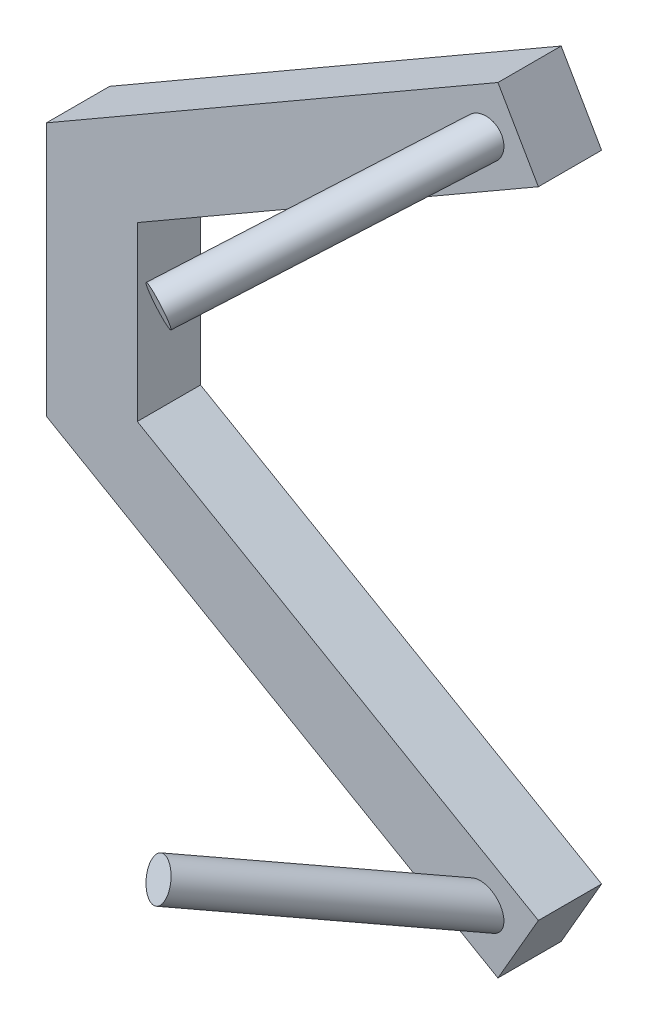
ISO-10303-21;
HEADER;
FILE_DESCRIPTION(('STEP AP214'),'2;1');
FILE_NAME('part.step','',(''),(''),'','','');
FILE_SCHEMA(('AUTOMOTIVE_DESIGN { 1 0 10303 214 1 1 1 1 }'));
ENDSEC;
DATA;
#1=APPLICATION_CONTEXT('core data for automotive mechanical design processes');
#2=APPLICATION_PROTOCOL_DEFINITION('international standard','automotive_design',2000,#1);
#3=PRODUCT_CONTEXT('',#1,'mechanical');
#4=PRODUCT('Part','Part','',(#3));
#5=PRODUCT_RELATED_PRODUCT_CATEGORY('part','',(#4));
#6=PRODUCT_DEFINITION_FORMATION('','',#4);
#7=PRODUCT_DEFINITION_CONTEXT('part definition',#1,'design');
#8=PRODUCT_DEFINITION('design','',#6,#7);
#9=PRODUCT_DEFINITION_SHAPE('','',#8);
#10=(LENGTH_UNIT() NAMED_UNIT(*) SI_UNIT(.MILLI.,.METRE.));
#11=(NAMED_UNIT(*) PLANE_ANGLE_UNIT() SI_UNIT($,.RADIAN.));
#12=(NAMED_UNIT(*) SI_UNIT($,.STERADIAN.) SOLID_ANGLE_UNIT());
#13=UNCERTAINTY_MEASURE_WITH_UNIT(LENGTH_MEASURE(1.E-05),#10,'distance_accuracy_value','');
#14=(GEOMETRIC_REPRESENTATION_CONTEXT(3) GLOBAL_UNCERTAINTY_ASSIGNED_CONTEXT((#13)) GLOBAL_UNIT_ASSIGNED_CONTEXT((#10,
#11,#12)) REPRESENTATION_CONTEXT('',''));
#15=CARTESIAN_POINT('',(0.,0.,0.));
#16=DIRECTION('',(0.,0.,1.));
#17=DIRECTION('',(1.,0.,0.));
#18=AXIS2_PLACEMENT_3D('',#15,#16,#17);
#19=CARTESIAN_POINT('',(0.,-200.960659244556,-100.));
#20=DIRECTION('',(-1.,0.,0.));
#21=DIRECTION('',(0.,-1.,0.));
#22=AXIS2_PLACEMENT_3D('',#19,#20,#21);
#23=PLANE('',#22);
#24=DIRECTION('',(0.,-1.,0.));
#25=VECTOR('',#24,1.);
#26=CARTESIAN_POINT('',(0.,-200.960659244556,0.));
#27=LINE('',#26,#25);
#28=CARTESIAN_POINT('',(0.,200.960659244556,0.));
#29=VERTEX_POINT('',#28);
#30=CARTESIAN_POINT('',(0.,-200.960659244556,0.));
#31=VERTEX_POINT('',#30);
#32=EDGE_CURVE('E125',#29,#31,#27,.T.);
#33=ORIENTED_EDGE('',*,*,#32,.F.);
#34=DIRECTION('',(0.,0.,1.));
#35=VECTOR('',#34,1.);
#36=CARTESIAN_POINT('',(0.,200.960659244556,-100.));
#37=LINE('',#36,#35);
#38=CARTESIAN_POINT('',(0.,200.960659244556,-100.));
#39=VERTEX_POINT('',#38);
#40=EDGE_CURVE('E117',#39,#29,#37,.T.);
#41=ORIENTED_EDGE('',*,*,#40,.F.);
#42=DIRECTION('',(0.,-1.,0.));
#43=VECTOR('',#42,1.);
#44=CARTESIAN_POINT('',(0.,-200.960659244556,-100.));
#45=LINE('',#44,#43);
#46=CARTESIAN_POINT('',(0.,-200.960659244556,-100.));
#47=VERTEX_POINT('',#46);
#48=EDGE_CURVE('E103',#39,#47,#45,.T.);
#49=ORIENTED_EDGE('',*,*,#48,.T.);
#50=DIRECTION('',(0.,0.,1.));
#51=VECTOR('',#50,1.);
#52=CARTESIAN_POINT('',(0.,-200.960659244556,-100.));
#53=LINE('',#52,#51);
#54=EDGE_CURVE('E76',#47,#31,#53,.T.);
#55=ORIENTED_EDGE('',*,*,#54,.T.);
#56=EDGE_LOOP('',(#33,#41,#49,#55));
#57=FACE_BOUND('',#56,.T.);
#58=ADVANCED_FACE('F33',(#57),#23,.T.);
#59=CARTESIAN_POINT('',(143.761573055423,0.,-100.));
#60=DIRECTION('',(1.,0.,0.));
#61=DIRECTION('',(0.,0.,-1.));
#62=AXIS2_PLACEMENT_3D('',#59,#60,#61);
#63=PLANE('',#62);
#64=DIRECTION('',(0.,1.,0.));
#65=VECTOR('',#64,1.);
#66=CARTESIAN_POINT('',(143.761573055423,0.,0.));
#67=LINE('',#66,#65);
#68=CARTESIAN_POINT('',(143.761573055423,-136.228327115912,0.));
#69=VERTEX_POINT('',#68);
#70=CARTESIAN_POINT('',(143.761573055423,136.228327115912,0.));
#71=VERTEX_POINT('',#70);
#72=EDGE_CURVE('E112',#69,#71,#67,.T.);
#73=ORIENTED_EDGE('',*,*,#72,.F.);
#74=DIRECTION('',(0.,0.,1.));
#75=VECTOR('',#74,1.);
#76=CARTESIAN_POINT('',(143.761573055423,-136.228327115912,-100.));
#77=LINE('',#76,#75);
#78=CARTESIAN_POINT('',(143.761573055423,-136.228327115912,-100.));
#79=VERTEX_POINT('',#78);
#80=EDGE_CURVE('E41',#79,#69,#77,.T.);
#81=ORIENTED_EDGE('',*,*,#80,.F.);
#82=DIRECTION('',(0.,1.,0.));
#83=VECTOR('',#82,1.);
#84=CARTESIAN_POINT('',(143.761573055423,0.,-100.));
#85=LINE('',#84,#83);
#86=CARTESIAN_POINT('',(143.761573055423,136.228327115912,-100.));
#87=VERTEX_POINT('',#86);
#88=EDGE_CURVE('E147',#79,#87,#85,.T.);
#89=ORIENTED_EDGE('',*,*,#88,.T.);
#90=DIRECTION('',(0.,0.,1.));
#91=VECTOR('',#90,1.);
#92=CARTESIAN_POINT('',(143.761573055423,136.228327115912,-100.));
#93=LINE('',#92,#91);
#94=EDGE_CURVE('E139',#87,#71,#93,.T.);
#95=ORIENTED_EDGE('',*,*,#94,.T.);
#96=EDGE_LOOP('',(#73,#81,#89,#95));
#97=FACE_BOUND('',#96,.T.);
#98=ADVANCED_FACE('F188',(#97),#63,.T.);
#99=CARTESIAN_POINT('',(143.761573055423,-136.228327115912,-100.));
#100=DIRECTION('',(0.500000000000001,0.866025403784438,0.));
#101=DIRECTION('',(-0.866025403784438,0.500000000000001,0.));
#102=AXIS2_PLACEMENT_3D('',#99,#100,#101);
#103=PLANE('',#102);
#104=DIRECTION('',(-0.866025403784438,0.500000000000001,0.));
#105=VECTOR('',#104,1.);
#106=CARTESIAN_POINT('',(143.761573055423,-136.228327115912,0.));
#107=LINE('',#106,#105);
#108=CARTESIAN_POINT('',(778.0726446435,-502.44799504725,0.));
#109=VERTEX_POINT('',#108);
#110=EDGE_CURVE('E156',#109,#69,#107,.T.);
#111=ORIENTED_EDGE('',*,*,#110,.F.);
#112=DIRECTION('',(0.,0.,1.));
#113=VECTOR('',#112,1.);
#114=CARTESIAN_POINT('',(778.0726446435,-502.44799504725,-100.));
#115=LINE('',#114,#113);
#116=CARTESIAN_POINT('',(778.0726446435,-502.44799504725,-100.));
#117=VERTEX_POINT('',#116);
#118=EDGE_CURVE('E66',#117,#109,#115,.T.);
#119=ORIENTED_EDGE('',*,*,#118,.F.);
#120=DIRECTION('',(-0.866025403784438,0.500000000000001,0.));
#121=VECTOR('',#120,1.);
#122=CARTESIAN_POINT('',(143.761573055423,-136.228327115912,-100.));
#123=LINE('',#122,#121);
#124=EDGE_CURVE('E145',#117,#79,#123,.T.);
#125=ORIENTED_EDGE('',*,*,#124,.T.);
#126=ORIENTED_EDGE('',*,*,#80,.T.);
#127=EDGE_LOOP('',(#111,#119,#125,#126));
#128=FACE_BOUND('',#127,.T.);
#129=ADVANCED_FACE('F205',(#128),#103,.T.);
#130=CARTESIAN_POINT('',(778.0726446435,-502.44799504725,-100.));
#131=DIRECTION('',(0.866025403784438,-0.500000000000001,0.));
#132=DIRECTION('',(0.500000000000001,0.866025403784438,0.));
#133=AXIS2_PLACEMENT_3D('',#130,#131,#132);
#134=PLANE('',#133);
#135=DIRECTION('',(0.500000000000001,0.866025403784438,0.));
#136=VECTOR('',#135,1.);
#137=CARTESIAN_POINT('',(778.0726446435,-502.44799504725,0.));
#138=LINE('',#137,#136);
#139=CARTESIAN_POINT('',(714.102329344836,-613.247831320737,0.));
#140=VERTEX_POINT('',#139);
#141=EDGE_CURVE('E153',#140,#109,#138,.T.);
#142=ORIENTED_EDGE('',*,*,#141,.F.);
#143=DIRECTION('',(0.,0.,1.));
#144=VECTOR('',#143,1.);
#145=CARTESIAN_POINT('',(714.102329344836,-613.247831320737,-100.));
#146=LINE('',#145,#144);
#147=CARTESIAN_POINT('',(714.102329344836,-613.247831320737,-100.));
#148=VERTEX_POINT('',#147);
#149=EDGE_CURVE('E162',#148,#140,#146,.T.);
#150=ORIENTED_EDGE('',*,*,#149,.F.);
#151=DIRECTION('',(0.500000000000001,0.866025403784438,0.));
#152=VECTOR('',#151,1.);
#153=CARTESIAN_POINT('',(778.0726446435,-502.44799504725,-100.));
#154=LINE('',#153,#152);
#155=EDGE_CURVE('E143',#148,#117,#154,.T.);
#156=ORIENTED_EDGE('',*,*,#155,.T.);
#157=ORIENTED_EDGE('',*,*,#118,.T.);
#158=EDGE_LOOP('',(#142,#150,#156,#157));
#159=FACE_BOUND('',#158,.T.);
#160=ADVANCED_FACE('F210',(#159),#134,.T.);
#161=CARTESIAN_POINT('',(714.102329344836,-613.247831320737,-100.));
#162=DIRECTION('',(-0.500000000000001,-0.866025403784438,0.));
#163=DIRECTION('',(0.866025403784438,-0.500000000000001,0.));
#164=AXIS2_PLACEMENT_3D('',#161,#162,#163);
#165=PLANE('',#164);
#166=DIRECTION('',(0.866025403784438,-0.500000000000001,0.));
#167=VECTOR('',#166,1.);
#168=CARTESIAN_POINT('',(714.102329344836,-613.247831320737,0.));
#169=LINE('',#168,#167);
#170=EDGE_CURVE('E150',#31,#140,#169,.T.);
#171=ORIENTED_EDGE('',*,*,#170,.F.);
#172=ORIENTED_EDGE('',*,*,#54,.F.);
#173=DIRECTION('',(0.866025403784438,-0.500000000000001,0.));
#174=VECTOR('',#173,1.);
#175=CARTESIAN_POINT('',(714.102329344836,-613.247831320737,-100.));
#176=LINE('',#175,#174);
#177=EDGE_CURVE('E109',#47,#148,#176,.T.);
#178=ORIENTED_EDGE('',*,*,#177,.T.);
#179=ORIENTED_EDGE('',*,*,#149,.T.);
#180=EDGE_LOOP('',(#171,#172,#178,#179));
#181=FACE_BOUND('',#180,.T.);
#182=ADVANCED_FACE('F163',(#181),#165,.T.);
#183=CARTESIAN_POINT('',(0.,0.,-100.));
#184=DIRECTION('',(0.,0.,-1.));
#185=DIRECTION('',(-1.,0.,0.));
#186=AXIS2_PLACEMENT_3D('',#183,#184,#185);
#187=PLANE('',#186);
#188=ORIENTED_EDGE('',*,*,#48,.F.);
#189=DIRECTION('',(0.866025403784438,0.500000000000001,0.));
#190=VECTOR('',#189,1.);
#191=CARTESIAN_POINT('',(714.102329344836,613.247831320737,-100.));
#192=LINE('',#191,#190);
#193=CARTESIAN_POINT('',(714.102329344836,613.247831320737,-100.));
#194=VERTEX_POINT('',#193);
#195=EDGE_CURVE('E106',#39,#194,#192,.T.);
#196=ORIENTED_EDGE('',*,*,#195,.T.);
#197=DIRECTION('',(0.500000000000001,-0.866025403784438,0.));
#198=VECTOR('',#197,1.);
#199=CARTESIAN_POINT('',(778.0726446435,502.44799504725,-100.));
#200=LINE('',#199,#198);
#201=CARTESIAN_POINT('',(778.0726446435,502.44799504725,-100.));
#202=VERTEX_POINT('',#201);
#203=EDGE_CURVE('E121',#194,#202,#200,.T.);
#204=ORIENTED_EDGE('',*,*,#203,.T.);
#205=DIRECTION('',(-0.866025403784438,-0.500000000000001,0.));
#206=VECTOR('',#205,1.);
#207=CARTESIAN_POINT('',(143.761573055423,136.228327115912,-100.));
#208=LINE('',#207,#206);
#209=EDGE_CURVE('E127',#202,#87,#208,.T.);
#210=ORIENTED_EDGE('',*,*,#209,.T.);
#211=ORIENTED_EDGE('',*,*,#88,.F.);
#212=ORIENTED_EDGE('',*,*,#124,.F.);
#213=ORIENTED_EDGE('',*,*,#155,.F.);
#214=ORIENTED_EDGE('',*,*,#177,.F.);
#215=EDGE_LOOP('',(#188,#196,#204,#210,#211,#212,#213,#214));
#216=FACE_BOUND('',#215,.T.);
#217=ADVANCED_FACE('F105',(#216),#187,.T.);
#218=CARTESIAN_POINT('',(0.,0.,0.));
#219=DIRECTION('',(0.,0.,-1.));
#220=DIRECTION('',(-1.,0.,0.));
#221=AXIS2_PLACEMENT_3D('',#218,#219,#220);
#222=PLANE('',#221);
#223=CARTESIAN_POINT('',(690.687568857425,-525.862755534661,0.));
#224=DIRECTION('',(0.,0.,-1.));
#225=DIRECTION('',(-0.76688536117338,0.641784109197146,0.));
#226=AXIS2_PLACEMENT_3D('',#223,#224,#225);
#227=ELLIPSE('',#226,34.7733392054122,30.);
#228=CARTESIAN_POINT('',(664.020404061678,-503.545779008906,0.));
#229=VERTEX_POINT('',#228);
#230=EDGE_CURVE('E11',#229,#229,#227,.T.);
#231=ORIENTED_EDGE('',*,*,#230,.T.);
#232=EDGE_LOOP('',(#231));
#233=FACE_BOUND('',#232,.T.);
#234=ORIENTED_EDGE('',*,*,#32,.T.);
#235=ORIENTED_EDGE('',*,*,#170,.T.);
#236=ORIENTED_EDGE('',*,*,#141,.T.);
#237=ORIENTED_EDGE('',*,*,#110,.T.);
#238=ORIENTED_EDGE('',*,*,#72,.T.);
#239=DIRECTION('',(-0.866025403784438,-0.500000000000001,0.));
#240=VECTOR('',#239,1.);
#241=CARTESIAN_POINT('',(143.761573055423,136.228327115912,0.));
#242=LINE('',#241,#240);
#243=CARTESIAN_POINT('',(778.0726446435,502.44799504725,0.));
#244=VERTEX_POINT('',#243);
#245=EDGE_CURVE('E122',#244,#71,#242,.T.);
#246=ORIENTED_EDGE('',*,*,#245,.F.);
#247=DIRECTION('',(0.500000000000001,-0.866025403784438,0.));
#248=VECTOR('',#247,1.);
#249=CARTESIAN_POINT('',(778.0726446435,502.44799504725,0.));
#250=LINE('',#249,#248);
#251=CARTESIAN_POINT('',(714.102329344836,613.247831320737,0.));
#252=VERTEX_POINT('',#251);
#253=EDGE_CURVE('E170',#252,#244,#250,.T.);
#254=ORIENTED_EDGE('',*,*,#253,.F.);
#255=DIRECTION('',(0.866025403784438,0.500000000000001,0.));
#256=VECTOR('',#255,1.);
#257=CARTESIAN_POINT('',(714.102329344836,613.247831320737,0.));
#258=LINE('',#257,#256);
#259=EDGE_CURVE('E168',#29,#252,#258,.T.);
#260=ORIENTED_EDGE('',*,*,#259,.F.);
#261=EDGE_LOOP('',(#234,#235,#236,#237,#238,#246,#254,#260));
#262=FACE_BOUND('',#261,.T.);
#263=CARTESIAN_POINT('',(690.687568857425,525.862755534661,0.));
#264=DIRECTION('',(0.,0.,1.));
#265=DIRECTION('',(-0.76688536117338,-0.641784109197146,0.));
#266=AXIS2_PLACEMENT_3D('',#263,#264,#265);
#267=ELLIPSE('',#266,34.7733392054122,30.);
#268=CARTESIAN_POINT('',(664.020404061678,503.545779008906,0.));
#269=VERTEX_POINT('',#268);
#270=EDGE_CURVE('E135',#269,#269,#267,.T.);
#271=ORIENTED_EDGE('',*,*,#270,.F.);
#272=EDGE_LOOP('',(#271));
#273=FACE_BOUND('',#272,.T.);
#274=ADVANCED_FACE('F165',(#233,#262,#273),#222,.F.);
#275=CARTESIAN_POINT('',(726.210159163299,-555.590580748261,-79.0289372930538));
#276=DIRECTION('',(-0.387787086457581,0.324527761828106,0.862729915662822));
#277=DIRECTION('',(0.912096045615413,0.,0.409976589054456));
#278=AXIS2_PLACEMENT_3D('',#275,#276,#277);
#279=CYLINDRICAL_SURFACE('',#278,30.);
#280=CARTESIAN_POINT('',(531.500969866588,-392.644109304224,354.150630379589));
#281=DIRECTION('',(-0.387787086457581,0.324527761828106,0.862729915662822));
#282=DIRECTION('',(0.912096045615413,0.,0.409976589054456));
#283=AXIS2_PLACEMENT_3D('',#280,#281,#282);
#284=CIRCLE('',#283,30.);
#285=CARTESIAN_POINT('',(558.86385123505,-392.644109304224,366.449928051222));
#286=VERTEX_POINT('',#285);
#287=EDGE_CURVE('E138',#286,#286,#284,.T.);
#288=ORIENTED_EDGE('',*,*,#287,.F.);
#289=EDGE_LOOP('',(#288));
#290=FACE_BOUND('',#289,.T.);
#291=ORIENTED_EDGE('',*,*,#230,.F.);
#292=EDGE_LOOP('',(#291));
#293=FACE_BOUND('',#292,.T.);
#294=ADVANCED_FACE('F223',(#290,#293),#279,.T.);
#295=CARTESIAN_POINT('',(531.500969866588,-392.644109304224,354.150630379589));
#296=DIRECTION('',(-0.387787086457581,0.324527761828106,0.862729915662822));
#297=DIRECTION('',(0.912096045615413,0.,0.409976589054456));
#298=AXIS2_PLACEMENT_3D('',#295,#296,#297);
#299=PLANE('',#298);
#300=ORIENTED_EDGE('',*,*,#287,.T.);
#301=EDGE_LOOP('',(#300));
#302=FACE_BOUND('',#301,.T.);
#303=ADVANCED_FACE('F199',(#302),#299,.T.);
#304=CARTESIAN_POINT('',(143.761573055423,136.228327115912,-100.));
#305=DIRECTION('',(0.500000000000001,-0.866025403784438,0.));
#306=DIRECTION('',(-0.866025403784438,-0.500000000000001,0.));
#307=AXIS2_PLACEMENT_3D('',#304,#305,#306);
#308=PLANE('',#307);
#309=ORIENTED_EDGE('',*,*,#245,.T.);
#310=ORIENTED_EDGE('',*,*,#94,.F.);
#311=ORIENTED_EDGE('',*,*,#209,.F.);
#312=DIRECTION('',(0.,0.,1.));
#313=VECTOR('',#312,1.);
#314=CARTESIAN_POINT('',(778.0726446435,502.44799504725,-100.));
#315=LINE('',#314,#313);
#316=EDGE_CURVE('E129',#202,#244,#315,.T.);
#317=ORIENTED_EDGE('',*,*,#316,.T.);
#318=EDGE_LOOP('',(#309,#310,#311,#317));
#319=FACE_BOUND('',#318,.T.);
#320=ADVANCED_FACE('F185',(#319),#308,.T.);
#321=CARTESIAN_POINT('',(778.0726446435,502.44799504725,-100.));
#322=DIRECTION('',(0.866025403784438,0.500000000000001,0.));
#323=DIRECTION('',(0.500000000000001,-0.866025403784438,0.));
#324=AXIS2_PLACEMENT_3D('',#321,#322,#323);
#325=PLANE('',#324);
#326=ORIENTED_EDGE('',*,*,#253,.T.);
#327=ORIENTED_EDGE('',*,*,#316,.F.);
#328=ORIENTED_EDGE('',*,*,#203,.F.);
#329=DIRECTION('',(0.,0.,1.));
#330=VECTOR('',#329,1.);
#331=CARTESIAN_POINT('',(714.102329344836,613.247831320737,-100.));
#332=LINE('',#331,#330);
#333=EDGE_CURVE('E119',#194,#252,#332,.T.);
#334=ORIENTED_EDGE('',*,*,#333,.T.);
#335=EDGE_LOOP('',(#326,#327,#328,#334));
#336=FACE_BOUND('',#335,.T.);
#337=ADVANCED_FACE('F190',(#336),#325,.T.);
#338=CARTESIAN_POINT('',(714.102329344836,613.247831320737,-100.));
#339=DIRECTION('',(-0.500000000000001,0.866025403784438,0.));
#340=DIRECTION('',(0.866025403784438,0.500000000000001,0.));
#341=AXIS2_PLACEMENT_3D('',#338,#339,#340);
#342=PLANE('',#341);
#343=ORIENTED_EDGE('',*,*,#259,.T.);
#344=ORIENTED_EDGE('',*,*,#333,.F.);
#345=ORIENTED_EDGE('',*,*,#195,.F.);
#346=ORIENTED_EDGE('',*,*,#40,.T.);
#347=EDGE_LOOP('',(#343,#344,#345,#346));
#348=FACE_BOUND('',#347,.T.);
#349=ADVANCED_FACE('F116',(#348),#342,.T.);
#350=CARTESIAN_POINT('',(726.210159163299,555.590580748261,-79.0289372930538));
#351=DIRECTION('',(-0.387787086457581,-0.324527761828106,0.862729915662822));
#352=DIRECTION('',(0.912096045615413,0.,0.409976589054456));
#353=AXIS2_PLACEMENT_3D('',#350,#351,#352);
#354=CYLINDRICAL_SURFACE('',#353,30.);
#355=CARTESIAN_POINT('',(531.500969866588,392.644109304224,354.150630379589));
#356=DIRECTION('',(0.387787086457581,0.324527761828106,-0.862729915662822));
#357=DIRECTION('',(0.912096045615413,0.,0.409976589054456));
#358=AXIS2_PLACEMENT_3D('',#355,#356,#357);
#359=CIRCLE('',#358,30.);
#360=CARTESIAN_POINT('',(558.86385123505,392.644109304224,366.449928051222));
#361=VERTEX_POINT('',#360);
#362=EDGE_CURVE('E171',#361,#361,#359,.T.);
#363=ORIENTED_EDGE('',*,*,#362,.T.);
#364=EDGE_LOOP('',(#363));
#365=FACE_BOUND('',#364,.T.);
#366=ORIENTED_EDGE('',*,*,#270,.T.);
#367=EDGE_LOOP('',(#366));
#368=FACE_BOUND('',#367,.T.);
#369=ADVANCED_FACE('F197',(#365,#368),#354,.T.);
#370=CARTESIAN_POINT('',(531.500969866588,392.644109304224,354.150630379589));
#371=DIRECTION('',(-0.387787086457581,-0.324527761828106,0.862729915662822));
#372=DIRECTION('',(0.912096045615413,0.,0.409976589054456));
#373=AXIS2_PLACEMENT_3D('',#370,#371,#372);
#374=PLANE('',#373);
#375=ORIENTED_EDGE('',*,*,#362,.F.);
#376=EDGE_LOOP('',(#375));
#377=FACE_BOUND('',#376,.T.);
#378=ADVANCED_FACE('F266',(#377),#374,.T.);
#379=CLOSED_SHELL('',(#58,#98,#129,#160,#182,#217,#274,#294,#303,#320,#337,#349,#369,#378));
#380=MANIFOLD_SOLID_BREP('B2',#379);
#381=ADVANCED_BREP_SHAPE_REPRESENTATION('',(#18,#380),#14);
#382=SHAPE_DEFINITION_REPRESENTATION(#9,#381);
ENDSEC;
END-ISO-10303-21;
